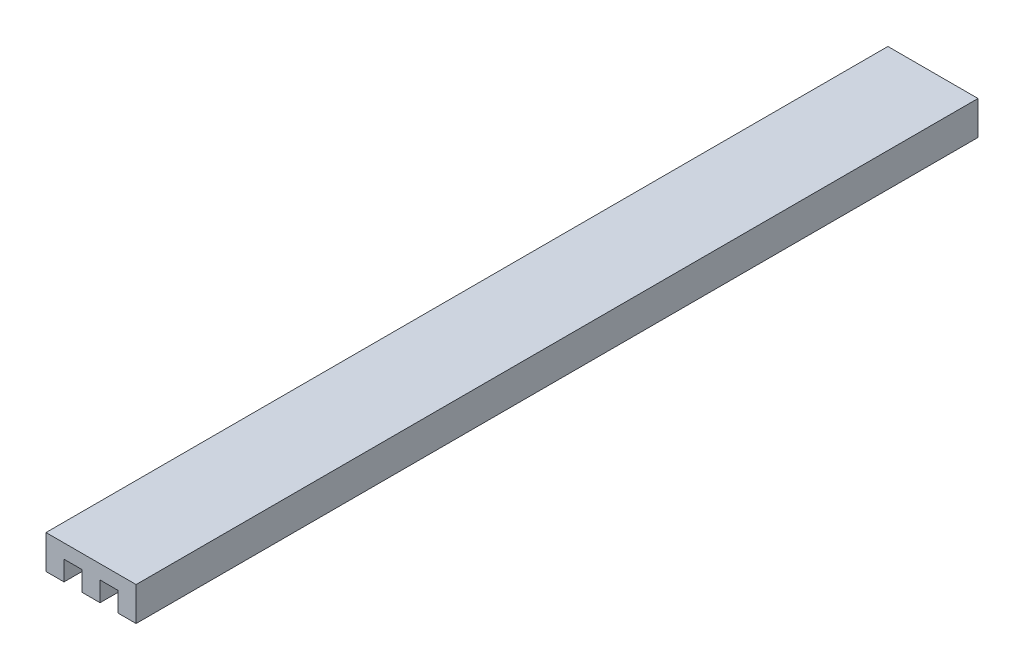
ISO-10303-21;
HEADER;
FILE_DESCRIPTION(('STEP AP214'),'2;1');
FILE_NAME('part.step','',(''),(''),'','','');
FILE_SCHEMA(('AUTOMOTIVE_DESIGN { 1 0 10303 214 1 1 1 1 }'));
ENDSEC;
DATA;
#1=APPLICATION_CONTEXT('core data for automotive mechanical design processes');
#2=APPLICATION_PROTOCOL_DEFINITION('international standard','automotive_design',2000,#1);
#3=PRODUCT_CONTEXT('',#1,'mechanical');
#4=PRODUCT('Part','Part','',(#3));
#5=PRODUCT_RELATED_PRODUCT_CATEGORY('part','',(#4));
#6=PRODUCT_DEFINITION_FORMATION('','',#4);
#7=PRODUCT_DEFINITION_CONTEXT('part definition',#1,'design');
#8=PRODUCT_DEFINITION('design','',#6,#7);
#9=PRODUCT_DEFINITION_SHAPE('','',#8);
#10=(LENGTH_UNIT() NAMED_UNIT(*) SI_UNIT(.MILLI.,.METRE.));
#11=(NAMED_UNIT(*) PLANE_ANGLE_UNIT() SI_UNIT($,.RADIAN.));
#12=(NAMED_UNIT(*) SI_UNIT($,.STERADIAN.) SOLID_ANGLE_UNIT());
#13=UNCERTAINTY_MEASURE_WITH_UNIT(LENGTH_MEASURE(1.E-05),#10,'distance_accuracy_value','');
#14=(GEOMETRIC_REPRESENTATION_CONTEXT(3) GLOBAL_UNCERTAINTY_ASSIGNED_CONTEXT((#13)) GLOBAL_UNIT_ASSIGNED_CONTEXT((#10,
#11,#12)) REPRESENTATION_CONTEXT('',''));
#15=CARTESIAN_POINT('',(0.,0.,0.));
#16=DIRECTION('',(0.,0.,1.));
#17=DIRECTION('',(1.,0.,0.));
#18=AXIS2_PLACEMENT_3D('',#15,#16,#17);
#19=CARTESIAN_POINT('',(0.,0.,149.5));
#20=DIRECTION('',(0.,-1.,0.));
#21=DIRECTION('',(0.,0.,-1.));
#22=AXIS2_PLACEMENT_3D('',#19,#20,#21);
#23=PLANE('',#22);
#24=DIRECTION('',(-1.,0.,0.));
#25=VECTOR('',#24,1.);
#26=CARTESIAN_POINT('',(0.,0.,0.));
#27=LINE('',#26,#25);
#28=CARTESIAN_POINT('',(16.,0.,0.));
#29=VERTEX_POINT('',#28);
#30=CARTESIAN_POINT('',(0.,0.,0.));
#31=VERTEX_POINT('',#30);
#32=EDGE_CURVE('E152',#29,#31,#27,.T.);
#33=ORIENTED_EDGE('',*,*,#32,.T.);
#34=DIRECTION('',(0.,0.,-1.));
#35=VECTOR('',#34,1.);
#36=CARTESIAN_POINT('',(0.,0.,149.5));
#37=LINE('',#36,#35);
#38=CARTESIAN_POINT('',(0.,0.,149.5));
#39=VERTEX_POINT('',#38);
#40=EDGE_CURVE('E11',#39,#31,#37,.T.);
#41=ORIENTED_EDGE('',*,*,#40,.F.);
#42=DIRECTION('',(-1.,0.,0.));
#43=VECTOR('',#42,1.);
#44=CARTESIAN_POINT('',(0.,0.,149.5));
#45=LINE('',#44,#43);
#46=CARTESIAN_POINT('',(16.,0.,149.5));
#47=VERTEX_POINT('',#46);
#48=EDGE_CURVE('E174',#47,#39,#45,.T.);
#49=ORIENTED_EDGE('',*,*,#48,.F.);
#50=DIRECTION('',(0.,0.,-1.));
#51=VECTOR('',#50,1.);
#52=CARTESIAN_POINT('',(16.,0.,149.5));
#53=LINE('',#52,#51);
#54=EDGE_CURVE('E148',#47,#29,#53,.T.);
#55=ORIENTED_EDGE('',*,*,#54,.T.);
#56=EDGE_LOOP('',(#33,#41,#49,#55));
#57=FACE_BOUND('',#56,.T.);
#58=ADVANCED_FACE('F32',(#57),#23,.F.);
#59=CARTESIAN_POINT('',(0.,-6.,149.5));
#60=DIRECTION('',(1.,0.,0.));
#61=DIRECTION('',(0.,1.,0.));
#62=AXIS2_PLACEMENT_3D('',#59,#60,#61);
#63=PLANE('',#62);
#64=DIRECTION('',(0.,-1.,0.));
#65=VECTOR('',#64,1.);
#66=CARTESIAN_POINT('',(0.,-6.,0.));
#67=LINE('',#66,#65);
#68=CARTESIAN_POINT('',(0.,-6.,0.));
#69=VERTEX_POINT('',#68);
#70=EDGE_CURVE('E155',#31,#69,#67,.T.);
#71=ORIENTED_EDGE('',*,*,#70,.T.);
#72=DIRECTION('',(0.,0.,-1.));
#73=VECTOR('',#72,1.);
#74=CARTESIAN_POINT('',(0.,-6.,149.5));
#75=LINE('',#74,#73);
#76=CARTESIAN_POINT('',(0.,-6.,149.5));
#77=VERTEX_POINT('',#76);
#78=EDGE_CURVE('E40',#77,#69,#75,.T.);
#79=ORIENTED_EDGE('',*,*,#78,.F.);
#80=DIRECTION('',(0.,-1.,0.));
#81=VECTOR('',#80,1.);
#82=CARTESIAN_POINT('',(0.,-6.,149.5));
#83=LINE('',#82,#81);
#84=EDGE_CURVE('E103',#39,#77,#83,.T.);
#85=ORIENTED_EDGE('',*,*,#84,.F.);
#86=ORIENTED_EDGE('',*,*,#40,.T.);
#87=EDGE_LOOP('',(#71,#79,#85,#86));
#88=FACE_BOUND('',#87,.T.);
#89=ADVANCED_FACE('F252',(#88),#63,.F.);
#90=CARTESIAN_POINT('',(3.2,-6.,149.5));
#91=DIRECTION('',(0.,1.,0.));
#92=DIRECTION('',(0.,0.,1.));
#93=AXIS2_PLACEMENT_3D('',#90,#91,#92);
#94=PLANE('',#93);
#95=DIRECTION('',(1.,0.,0.));
#96=VECTOR('',#95,1.);
#97=CARTESIAN_POINT('',(3.2,-6.,0.));
#98=LINE('',#97,#96);
#99=CARTESIAN_POINT('',(3.2,-6.,0.));
#100=VERTEX_POINT('',#99);
#101=EDGE_CURVE('E157',#69,#100,#98,.T.);
#102=ORIENTED_EDGE('',*,*,#101,.T.);
#103=DIRECTION('',(0.,0.,-1.));
#104=VECTOR('',#103,1.);
#105=CARTESIAN_POINT('',(3.2,-6.,149.5));
#106=LINE('',#105,#104);
#107=CARTESIAN_POINT('',(3.2,-6.,149.5));
#108=VERTEX_POINT('',#107);
#109=EDGE_CURVE('E193',#108,#100,#106,.T.);
#110=ORIENTED_EDGE('',*,*,#109,.F.);
#111=DIRECTION('',(1.,0.,0.));
#112=VECTOR('',#111,1.);
#113=CARTESIAN_POINT('',(3.2,-6.,149.5));
#114=LINE('',#113,#112);
#115=EDGE_CURVE('E201',#77,#108,#114,.T.);
#116=ORIENTED_EDGE('',*,*,#115,.F.);
#117=ORIENTED_EDGE('',*,*,#78,.T.);
#118=EDGE_LOOP('',(#102,#110,#116,#117));
#119=FACE_BOUND('',#118,.T.);
#120=ADVANCED_FACE('F199',(#119),#94,.F.);
#121=CARTESIAN_POINT('',(3.2,-2.5,149.5));
#122=DIRECTION('',(-1.,0.,0.));
#123=DIRECTION('',(0.,-1.,0.));
#124=AXIS2_PLACEMENT_3D('',#121,#122,#123);
#125=PLANE('',#124);
#126=DIRECTION('',(0.,1.,0.));
#127=VECTOR('',#126,1.);
#128=CARTESIAN_POINT('',(3.2,-2.5,0.));
#129=LINE('',#128,#127);
#130=CARTESIAN_POINT('',(3.2,-2.5,0.));
#131=VERTEX_POINT('',#130);
#132=EDGE_CURVE('E159',#100,#131,#129,.T.);
#133=ORIENTED_EDGE('',*,*,#132,.T.);
#134=DIRECTION('',(0.,0.,-1.));
#135=VECTOR('',#134,1.);
#136=CARTESIAN_POINT('',(3.2,-2.5,149.5));
#137=LINE('',#136,#135);
#138=CARTESIAN_POINT('',(3.2,-2.5,149.5));
#139=VERTEX_POINT('',#138);
#140=EDGE_CURVE('E190',#139,#131,#137,.T.);
#141=ORIENTED_EDGE('',*,*,#140,.F.);
#142=DIRECTION('',(0.,1.,0.));
#143=VECTOR('',#142,1.);
#144=CARTESIAN_POINT('',(3.2,-2.5,149.5));
#145=LINE('',#144,#143);
#146=EDGE_CURVE('E219',#108,#139,#145,.T.);
#147=ORIENTED_EDGE('',*,*,#146,.F.);
#148=ORIENTED_EDGE('',*,*,#109,.T.);
#149=EDGE_LOOP('',(#133,#141,#147,#148));
#150=FACE_BOUND('',#149,.T.);
#151=ADVANCED_FACE('F210',(#150),#125,.F.);
#152=CARTESIAN_POINT('',(6.4,-2.5,149.5));
#153=DIRECTION('',(0.,1.,0.));
#154=DIRECTION('',(-1.,0.,0.));
#155=AXIS2_PLACEMENT_3D('',#152,#153,#154);
#156=PLANE('',#155);
#157=DIRECTION('',(1.,0.,0.));
#158=VECTOR('',#157,1.);
#159=CARTESIAN_POINT('',(6.4,-2.5,0.));
#160=LINE('',#159,#158);
#161=CARTESIAN_POINT('',(6.4,-2.5,0.));
#162=VERTEX_POINT('',#161);
#163=EDGE_CURVE('E161',#131,#162,#160,.T.);
#164=ORIENTED_EDGE('',*,*,#163,.T.);
#165=DIRECTION('',(0.,0.,-1.));
#166=VECTOR('',#165,1.);
#167=CARTESIAN_POINT('',(6.4,-2.5,149.5));
#168=LINE('',#167,#166);
#169=CARTESIAN_POINT('',(6.4,-2.5,149.5));
#170=VERTEX_POINT('',#169);
#171=EDGE_CURVE('E187',#170,#162,#168,.T.);
#172=ORIENTED_EDGE('',*,*,#171,.F.);
#173=DIRECTION('',(1.,0.,0.));
#174=VECTOR('',#173,1.);
#175=CARTESIAN_POINT('',(6.4,-2.5,149.5));
#176=LINE('',#175,#174);
#177=EDGE_CURVE('E216',#139,#170,#176,.T.);
#178=ORIENTED_EDGE('',*,*,#177,.F.);
#179=ORIENTED_EDGE('',*,*,#140,.T.);
#180=EDGE_LOOP('',(#164,#172,#178,#179));
#181=FACE_BOUND('',#180,.T.);
#182=ADVANCED_FACE('F214',(#181),#156,.F.);
#183=CARTESIAN_POINT('',(6.4,-6.,149.5));
#184=DIRECTION('',(1.,0.,0.));
#185=DIRECTION('',(0.,1.,0.));
#186=AXIS2_PLACEMENT_3D('',#183,#184,#185);
#187=PLANE('',#186);
#188=DIRECTION('',(0.,-1.,0.));
#189=VECTOR('',#188,1.);
#190=CARTESIAN_POINT('',(6.4,-6.,0.));
#191=LINE('',#190,#189);
#192=CARTESIAN_POINT('',(6.4,-6.,0.));
#193=VERTEX_POINT('',#192);
#194=EDGE_CURVE('E163',#162,#193,#191,.T.);
#195=ORIENTED_EDGE('',*,*,#194,.T.);
#196=DIRECTION('',(0.,0.,-1.));
#197=VECTOR('',#196,1.);
#198=CARTESIAN_POINT('',(6.4,-6.,149.5));
#199=LINE('',#198,#197);
#200=CARTESIAN_POINT('',(6.4,-6.,149.5));
#201=VERTEX_POINT('',#200);
#202=EDGE_CURVE('E184',#201,#193,#199,.T.);
#203=ORIENTED_EDGE('',*,*,#202,.F.);
#204=DIRECTION('',(0.,-1.,0.));
#205=VECTOR('',#204,1.);
#206=CARTESIAN_POINT('',(6.4,-6.,149.5));
#207=LINE('',#206,#205);
#208=EDGE_CURVE('E218',#170,#201,#207,.T.);
#209=ORIENTED_EDGE('',*,*,#208,.F.);
#210=ORIENTED_EDGE('',*,*,#171,.T.);
#211=EDGE_LOOP('',(#195,#203,#209,#210));
#212=FACE_BOUND('',#211,.T.);
#213=ADVANCED_FACE('F265',(#212),#187,.F.);
#214=CARTESIAN_POINT('',(9.6,-6.,149.5));
#215=DIRECTION('',(0.,1.,0.));
#216=DIRECTION('',(-1.,0.,0.));
#217=AXIS2_PLACEMENT_3D('',#214,#215,#216);
#218=PLANE('',#217);
#219=DIRECTION('',(1.,0.,0.));
#220=VECTOR('',#219,1.);
#221=CARTESIAN_POINT('',(9.6,-6.,0.));
#222=LINE('',#221,#220);
#223=CARTESIAN_POINT('',(9.6,-6.,0.));
#224=VERTEX_POINT('',#223);
#225=EDGE_CURVE('E165',#193,#224,#222,.T.);
#226=ORIENTED_EDGE('',*,*,#225,.T.);
#227=DIRECTION('',(0.,0.,-1.));
#228=VECTOR('',#227,1.);
#229=CARTESIAN_POINT('',(9.6,-6.,149.5));
#230=LINE('',#229,#228);
#231=CARTESIAN_POINT('',(9.6,-6.,149.5));
#232=VERTEX_POINT('',#231);
#233=EDGE_CURVE('E181',#232,#224,#230,.T.);
#234=ORIENTED_EDGE('',*,*,#233,.F.);
#235=DIRECTION('',(1.,0.,0.));
#236=VECTOR('',#235,1.);
#237=CARTESIAN_POINT('',(9.6,-6.,149.5));
#238=LINE('',#237,#236);
#239=EDGE_CURVE('E221',#201,#232,#238,.T.);
#240=ORIENTED_EDGE('',*,*,#239,.F.);
#241=ORIENTED_EDGE('',*,*,#202,.T.);
#242=EDGE_LOOP('',(#226,#234,#240,#241));
#243=FACE_BOUND('',#242,.T.);
#244=ADVANCED_FACE('F268',(#243),#218,.F.);
#245=CARTESIAN_POINT('',(9.6,-2.5,149.5));
#246=DIRECTION('',(-1.,0.,0.));
#247=DIRECTION('',(0.,-1.,0.));
#248=AXIS2_PLACEMENT_3D('',#245,#246,#247);
#249=PLANE('',#248);
#250=DIRECTION('',(0.,1.,0.));
#251=VECTOR('',#250,1.);
#252=CARTESIAN_POINT('',(9.6,-2.5,0.));
#253=LINE('',#252,#251);
#254=CARTESIAN_POINT('',(9.6,-2.5,0.));
#255=VERTEX_POINT('',#254);
#256=EDGE_CURVE('E167',#224,#255,#253,.T.);
#257=ORIENTED_EDGE('',*,*,#256,.T.);
#258=DIRECTION('',(0.,0.,-1.));
#259=VECTOR('',#258,1.);
#260=CARTESIAN_POINT('',(9.6,-2.5,149.5));
#261=LINE('',#260,#259);
#262=CARTESIAN_POINT('',(9.6,-2.5,149.5));
#263=VERTEX_POINT('',#262);
#264=EDGE_CURVE('E178',#263,#255,#261,.T.);
#265=ORIENTED_EDGE('',*,*,#264,.F.);
#266=DIRECTION('',(0.,1.,0.));
#267=VECTOR('',#266,1.);
#268=CARTESIAN_POINT('',(9.6,-2.5,149.5));
#269=LINE('',#268,#267);
#270=EDGE_CURVE('E227',#232,#263,#269,.T.);
#271=ORIENTED_EDGE('',*,*,#270,.F.);
#272=ORIENTED_EDGE('',*,*,#233,.T.);
#273=EDGE_LOOP('',(#257,#265,#271,#272));
#274=FACE_BOUND('',#273,.T.);
#275=ADVANCED_FACE('F233',(#274),#249,.F.);
#276=CARTESIAN_POINT('',(12.8,-2.5,149.5));
#277=DIRECTION('',(0.,1.,0.));
#278=DIRECTION('',(0.,0.,1.));
#279=AXIS2_PLACEMENT_3D('',#276,#277,#278);
#280=PLANE('',#279);
#281=DIRECTION('',(1.,0.,0.));
#282=VECTOR('',#281,1.);
#283=CARTESIAN_POINT('',(12.8,-2.5,0.));
#284=LINE('',#283,#282);
#285=CARTESIAN_POINT('',(12.8,-2.5,0.));
#286=VERTEX_POINT('',#285);
#287=EDGE_CURVE('E169',#255,#286,#284,.T.);
#288=ORIENTED_EDGE('',*,*,#287,.T.);
#289=DIRECTION('',(0.,0.,-1.));
#290=VECTOR('',#289,1.);
#291=CARTESIAN_POINT('',(12.8,-2.5,149.5));
#292=LINE('',#291,#290);
#293=CARTESIAN_POINT('',(12.8,-2.5,149.5));
#294=VERTEX_POINT('',#293);
#295=EDGE_CURVE('E143',#294,#286,#292,.T.);
#296=ORIENTED_EDGE('',*,*,#295,.F.);
#297=DIRECTION('',(1.,0.,0.));
#298=VECTOR('',#297,1.);
#299=CARTESIAN_POINT('',(12.8,-2.5,149.5));
#300=LINE('',#299,#298);
#301=EDGE_CURVE('E134',#263,#294,#300,.T.);
#302=ORIENTED_EDGE('',*,*,#301,.F.);
#303=ORIENTED_EDGE('',*,*,#264,.T.);
#304=EDGE_LOOP('',(#288,#296,#302,#303));
#305=FACE_BOUND('',#304,.T.);
#306=ADVANCED_FACE('F237',(#305),#280,.F.);
#307=CARTESIAN_POINT('',(12.8,-6.,149.5));
#308=DIRECTION('',(1.,0.,0.));
#309=DIRECTION('',(0.,1.,0.));
#310=AXIS2_PLACEMENT_3D('',#307,#308,#309);
#311=PLANE('',#310);
#312=DIRECTION('',(0.,-1.,0.));
#313=VECTOR('',#312,1.);
#314=CARTESIAN_POINT('',(12.8,-6.,0.));
#315=LINE('',#314,#313);
#316=CARTESIAN_POINT('',(12.8,-6.,0.));
#317=VERTEX_POINT('',#316);
#318=EDGE_CURVE('E142',#286,#317,#315,.T.);
#319=ORIENTED_EDGE('',*,*,#318,.T.);
#320=DIRECTION('',(0.,0.,-1.));
#321=VECTOR('',#320,1.);
#322=CARTESIAN_POINT('',(12.8,-6.,149.5));
#323=LINE('',#322,#321);
#324=CARTESIAN_POINT('',(12.8,-6.,149.5));
#325=VERTEX_POINT('',#324);
#326=EDGE_CURVE('E139',#325,#317,#323,.T.);
#327=ORIENTED_EDGE('',*,*,#326,.F.);
#328=DIRECTION('',(0.,-1.,0.));
#329=VECTOR('',#328,1.);
#330=CARTESIAN_POINT('',(12.8,-6.,149.5));
#331=LINE('',#330,#329);
#332=EDGE_CURVE('E128',#294,#325,#331,.T.);
#333=ORIENTED_EDGE('',*,*,#332,.F.);
#334=ORIENTED_EDGE('',*,*,#295,.T.);
#335=EDGE_LOOP('',(#319,#327,#333,#334));
#336=FACE_BOUND('',#335,.T.);
#337=ADVANCED_FACE('F140',(#336),#311,.F.);
#338=CARTESIAN_POINT('',(16.,-6.,149.5));
#339=DIRECTION('',(0.,1.,0.));
#340=DIRECTION('',(-1.,0.,0.));
#341=AXIS2_PLACEMENT_3D('',#338,#339,#340);
#342=PLANE('',#341);
#343=DIRECTION('',(1.,0.,0.));
#344=VECTOR('',#343,1.);
#345=CARTESIAN_POINT('',(16.,-6.,0.));
#346=LINE('',#345,#344);
#347=CARTESIAN_POINT('',(16.,-6.,0.));
#348=VERTEX_POINT('',#347);
#349=EDGE_CURVE('E89',#317,#348,#346,.T.);
#350=ORIENTED_EDGE('',*,*,#349,.T.);
#351=DIRECTION('',(0.,0.,-1.));
#352=VECTOR('',#351,1.);
#353=CARTESIAN_POINT('',(16.,-6.,149.5));
#354=LINE('',#353,#352);
#355=CARTESIAN_POINT('',(16.,-6.,149.5));
#356=VERTEX_POINT('',#355);
#357=EDGE_CURVE('E144',#356,#348,#354,.T.);
#358=ORIENTED_EDGE('',*,*,#357,.F.);
#359=DIRECTION('',(1.,0.,0.));
#360=VECTOR('',#359,1.);
#361=CARTESIAN_POINT('',(16.,-6.,149.5));
#362=LINE('',#361,#360);
#363=EDGE_CURVE('E132',#325,#356,#362,.T.);
#364=ORIENTED_EDGE('',*,*,#363,.F.);
#365=ORIENTED_EDGE('',*,*,#326,.T.);
#366=EDGE_LOOP('',(#350,#358,#364,#365));
#367=FACE_BOUND('',#366,.T.);
#368=ADVANCED_FACE('F146',(#367),#342,.F.);
#369=CARTESIAN_POINT('',(16.,0.,149.5));
#370=DIRECTION('',(-1.,0.,0.));
#371=DIRECTION('',(0.,-1.,0.));
#372=AXIS2_PLACEMENT_3D('',#369,#370,#371);
#373=PLANE('',#372);
#374=DIRECTION('',(0.,1.,0.));
#375=VECTOR('',#374,1.);
#376=CARTESIAN_POINT('',(16.,0.,0.));
#377=LINE('',#376,#375);
#378=EDGE_CURVE('E95',#348,#29,#377,.T.);
#379=ORIENTED_EDGE('',*,*,#378,.T.);
#380=ORIENTED_EDGE('',*,*,#54,.F.);
#381=DIRECTION('',(0.,1.,0.));
#382=VECTOR('',#381,1.);
#383=CARTESIAN_POINT('',(16.,0.,149.5));
#384=LINE('',#383,#382);
#385=EDGE_CURVE('E48',#356,#47,#384,.T.);
#386=ORIENTED_EDGE('',*,*,#385,.F.);
#387=ORIENTED_EDGE('',*,*,#357,.T.);
#388=EDGE_LOOP('',(#379,#380,#386,#387));
#389=FACE_BOUND('',#388,.T.);
#390=ADVANCED_FACE('F241',(#389),#373,.F.);
#391=CARTESIAN_POINT('',(16.,0.,149.5));
#392=DIRECTION('',(0.,0.,-1.));
#393=DIRECTION('',(-1.,0.,0.));
#394=AXIS2_PLACEMENT_3D('',#391,#392,#393);
#395=PLANE('',#394);
#396=ORIENTED_EDGE('',*,*,#48,.T.);
#397=ORIENTED_EDGE('',*,*,#84,.T.);
#398=ORIENTED_EDGE('',*,*,#115,.T.);
#399=ORIENTED_EDGE('',*,*,#146,.T.);
#400=ORIENTED_EDGE('',*,*,#177,.T.);
#401=ORIENTED_EDGE('',*,*,#208,.T.);
#402=ORIENTED_EDGE('',*,*,#239,.T.);
#403=ORIENTED_EDGE('',*,*,#270,.T.);
#404=ORIENTED_EDGE('',*,*,#301,.T.);
#405=ORIENTED_EDGE('',*,*,#332,.T.);
#406=ORIENTED_EDGE('',*,*,#363,.T.);
#407=ORIENTED_EDGE('',*,*,#385,.T.);
#408=EDGE_LOOP('',(#396,#397,#398,#399,#400,#401,#402,#403,#404,#405,#406,#407));
#409=FACE_BOUND('',#408,.T.);
#410=ADVANCED_FACE('F130',(#409),#395,.F.);
#411=CARTESIAN_POINT('',(16.,0.,0.));
#412=DIRECTION('',(0.,0.,-1.));
#413=DIRECTION('',(-1.,0.,0.));
#414=AXIS2_PLACEMENT_3D('',#411,#412,#413);
#415=PLANE('',#414);
#416=ORIENTED_EDGE('',*,*,#32,.F.);
#417=ORIENTED_EDGE('',*,*,#378,.F.);
#418=ORIENTED_EDGE('',*,*,#349,.F.);
#419=ORIENTED_EDGE('',*,*,#318,.F.);
#420=ORIENTED_EDGE('',*,*,#287,.F.);
#421=ORIENTED_EDGE('',*,*,#256,.F.);
#422=ORIENTED_EDGE('',*,*,#225,.F.);
#423=ORIENTED_EDGE('',*,*,#194,.F.);
#424=ORIENTED_EDGE('',*,*,#163,.F.);
#425=ORIENTED_EDGE('',*,*,#132,.F.);
#426=ORIENTED_EDGE('',*,*,#101,.F.);
#427=ORIENTED_EDGE('',*,*,#70,.F.);
#428=EDGE_LOOP('',(#416,#417,#418,#419,#420,#421,#422,#423,#424,#425,#426,#427));
#429=FACE_BOUND('',#428,.T.);
#430=ADVANCED_FACE('F205',(#429),#415,.T.);
#431=CLOSED_SHELL('',(#58,#89,#120,#151,#182,#213,#244,#275,#306,#337,#368,#390,#410,#430));
#432=MANIFOLD_SOLID_BREP('B2',#431);
#433=ADVANCED_BREP_SHAPE_REPRESENTATION('',(#18,#432),#14);
#434=SHAPE_DEFINITION_REPRESENTATION(#9,#433);
ENDSEC;
END-ISO-10303-21;
